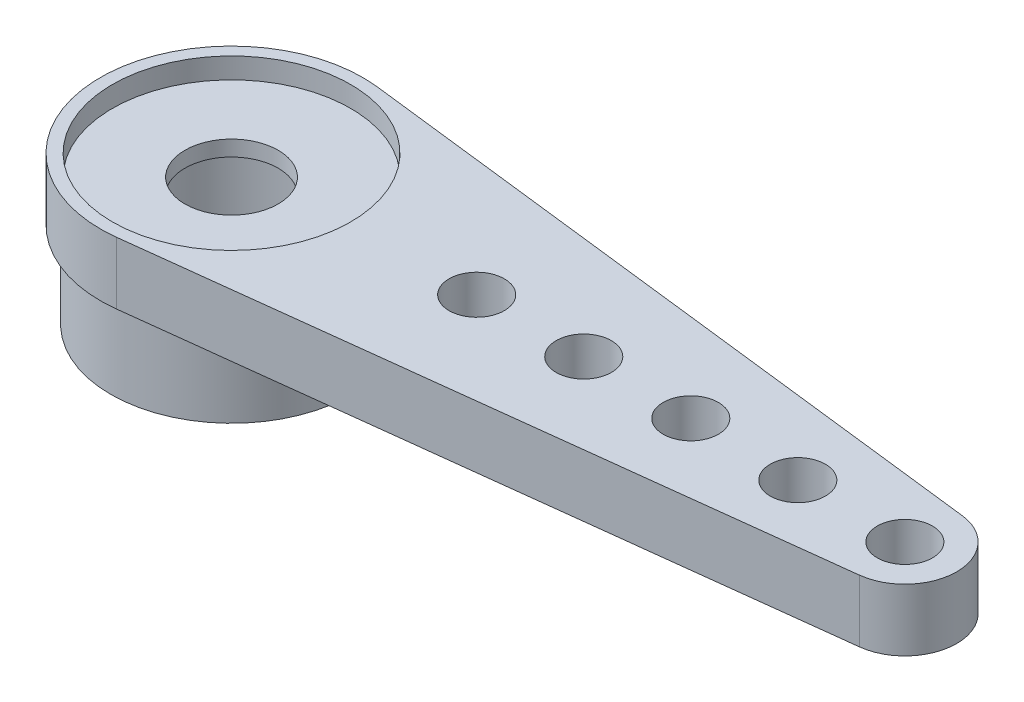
ISO-10303-21;
HEADER;
FILE_DESCRIPTION(('STEP AP214'),'2;1');
FILE_NAME('part.step','',(''),(''),'','','');
FILE_SCHEMA(('AUTOMOTIVE_DESIGN { 1 0 10303 214 1 1 1 1 }'));
ENDSEC;
DATA;
#1=APPLICATION_CONTEXT('core data for automotive mechanical design processes');
#2=APPLICATION_PROTOCOL_DEFINITION('international standard','automotive_design',2000,#1);
#3=PRODUCT_CONTEXT('',#1,'mechanical');
#4=PRODUCT('Part','Part','',(#3));
#5=PRODUCT_RELATED_PRODUCT_CATEGORY('part','',(#4));
#6=PRODUCT_DEFINITION_FORMATION('','',#4);
#7=PRODUCT_DEFINITION_CONTEXT('part definition',#1,'design');
#8=PRODUCT_DEFINITION('design','',#6,#7);
#9=PRODUCT_DEFINITION_SHAPE('','',#8);
#10=(LENGTH_UNIT() NAMED_UNIT(*) SI_UNIT(.MILLI.,.METRE.));
#11=(NAMED_UNIT(*) PLANE_ANGLE_UNIT() SI_UNIT($,.RADIAN.));
#12=(NAMED_UNIT(*) SI_UNIT($,.STERADIAN.) SOLID_ANGLE_UNIT());
#13=UNCERTAINTY_MEASURE_WITH_UNIT(LENGTH_MEASURE(1.E-05),#10,'distance_accuracy_value','');
#14=(GEOMETRIC_REPRESENTATION_CONTEXT(3) GLOBAL_UNCERTAINTY_ASSIGNED_CONTEXT((#13)) GLOBAL_UNIT_ASSIGNED_CONTEXT((#10,
#11,#12)) REPRESENTATION_CONTEXT('',''));
#15=CARTESIAN_POINT('',(0.,0.,0.));
#16=DIRECTION('',(0.,0.,1.));
#17=DIRECTION('',(1.,0.,0.));
#18=AXIS2_PLACEMENT_3D('',#15,#16,#17);
#19=CARTESIAN_POINT('',(0.,1.8,0.));
#20=DIRECTION('',(0.,-1.,0.));
#21=DIRECTION('',(0.,0.,-1.));
#22=AXIS2_PLACEMENT_3D('',#19,#20,#21);
#23=CYLINDRICAL_SURFACE('',#22,1.35);
#24=CARTESIAN_POINT('',(0.,0.75,0.));
#25=DIRECTION('',(0.,-1.,0.));
#26=DIRECTION('',(0.,0.,-1.));
#27=AXIS2_PLACEMENT_3D('',#24,#25,#26);
#28=CIRCLE('',#27,1.35);
#29=CARTESIAN_POINT('',(0.,0.75,-1.35));
#30=VERTEX_POINT('',#29);
#31=EDGE_CURVE('E113',#30,#30,#28,.T.);
#32=ORIENTED_EDGE('',*,*,#31,.T.);
#33=EDGE_LOOP('',(#32));
#34=FACE_BOUND('',#33,.T.);
#35=CARTESIAN_POINT('',(0.,1.2,0.));
#36=DIRECTION('',(0.,1.,0.));
#37=DIRECTION('',(0.,0.,1.));
#38=AXIS2_PLACEMENT_3D('',#35,#36,#37);
#39=CIRCLE('',#38,1.35);
#40=CARTESIAN_POINT('',(0.,1.2,1.35));
#41=VERTEX_POINT('',#40);
#42=EDGE_CURVE('E38',#41,#41,#39,.T.);
#43=ORIENTED_EDGE('',*,*,#42,.T.);
#44=EDGE_LOOP('',(#43));
#45=FACE_BOUND('',#44,.T.);
#46=ADVANCED_FACE('F34',(#34,#45),#23,.F.);
#47=CARTESIAN_POINT('',(0.,0.,0.));
#48=DIRECTION('',(0.,1.,0.));
#49=DIRECTION('',(0.,0.,1.));
#50=AXIS2_PLACEMENT_3D('',#47,#48,#49);
#51=PLANE('',#50);
#52=CARTESIAN_POINT('',(16.4,0.,0.));
#53=DIRECTION('',(0.,1.,0.));
#54=DIRECTION('',(0.,0.,1.));
#55=AXIS2_PLACEMENT_3D('',#52,#53,#54);
#56=CIRCLE('',#55,0.799999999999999);
#57=CARTESIAN_POINT('',(16.4,0.,0.799999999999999));
#58=VERTEX_POINT('',#57);
#59=EDGE_CURVE('E120',#58,#58,#56,.T.);
#60=ORIENTED_EDGE('',*,*,#59,.T.);
#61=EDGE_LOOP('',(#60));
#62=FACE_BOUND('',#61,.T.);
#63=CARTESIAN_POINT('',(10.2,0.,0.));
#64=DIRECTION('',(0.,1.,0.));
#65=DIRECTION('',(0.,0.,1.));
#66=AXIS2_PLACEMENT_3D('',#63,#64,#65);
#67=CIRCLE('',#66,0.800000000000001);
#68=CARTESIAN_POINT('',(10.2,0.,0.800000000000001));
#69=VERTEX_POINT('',#68);
#70=EDGE_CURVE('E142',#69,#69,#67,.T.);
#71=ORIENTED_EDGE('',*,*,#70,.T.);
#72=EDGE_LOOP('',(#71));
#73=FACE_BOUND('',#72,.T.);
#74=CARTESIAN_POINT('',(19.5,0.,0.));
#75=DIRECTION('',(0.,1.,0.));
#76=DIRECTION('',(0.,0.,1.));
#77=AXIS2_PLACEMENT_3D('',#74,#75,#76);
#78=CIRCLE('',#77,0.800000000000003);
#79=CARTESIAN_POINT('',(19.5,0.,0.800000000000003));
#80=VERTEX_POINT('',#79);
#81=EDGE_CURVE('E154',#80,#80,#78,.T.);
#82=ORIENTED_EDGE('',*,*,#81,.T.);
#83=EDGE_LOOP('',(#82));
#84=FACE_BOUND('',#83,.T.);
#85=CARTESIAN_POINT('',(0.,0.,0.));
#86=DIRECTION('',(0.,1.,0.));
#87=DIRECTION('',(0.,0.,1.));
#88=AXIS2_PLACEMENT_3D('',#85,#86,#87);
#89=CIRCLE('',#88,3.8);
#90=CARTESIAN_POINT('',(0.448205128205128,0.,-3.77347481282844));
#91=VERTEX_POINT('',#90);
#92=CARTESIAN_POINT('',(0.448205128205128,0.,3.77347481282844));
#93=VERTEX_POINT('',#92);
#94=EDGE_CURVE('E104',#91,#93,#89,.T.);
#95=ORIENTED_EDGE('',*,*,#94,.F.);
#96=DIRECTION('',(-0.993019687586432,0.,-0.117948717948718));
#97=VECTOR('',#96,1.);
#98=CARTESIAN_POINT('',(0.448205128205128,0.,-3.77347481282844));
#99=LINE('',#98,#97);
#100=CARTESIAN_POINT('',(19.6769230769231,0.,-1.48952953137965));
#101=VERTEX_POINT('',#100);
#102=EDGE_CURVE('E76',#101,#91,#99,.T.);
#103=ORIENTED_EDGE('',*,*,#102,.F.);
#104=CARTESIAN_POINT('',(19.5,0.,0.));
#105=DIRECTION('',(0.,1.,0.));
#106=DIRECTION('',(0.,0.,1.));
#107=AXIS2_PLACEMENT_3D('',#104,#105,#106);
#108=CIRCLE('',#107,1.5);
#109=CARTESIAN_POINT('',(19.6769230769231,0.,1.48952953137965));
#110=VERTEX_POINT('',#109);
#111=EDGE_CURVE('E70',#110,#101,#108,.T.);
#112=ORIENTED_EDGE('',*,*,#111,.F.);
#113=DIRECTION('',(0.993019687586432,0.,-0.117948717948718));
#114=VECTOR('',#113,1.);
#115=CARTESIAN_POINT('',(19.6769230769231,0.,1.48952953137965));
#116=LINE('',#115,#114);
#117=EDGE_CURVE('E95',#93,#110,#116,.T.);
#118=ORIENTED_EDGE('',*,*,#117,.F.);
#119=EDGE_LOOP('',(#95,#103,#112,#118));
#120=FACE_BOUND('',#119,.T.);
#121=CARTESIAN_POINT('',(7.1,0.,0.));
#122=DIRECTION('',(0.,1.,0.));
#123=DIRECTION('',(0.,0.,1.));
#124=AXIS2_PLACEMENT_3D('',#121,#122,#123);
#125=CIRCLE('',#124,0.800000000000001);
#126=CARTESIAN_POINT('',(7.1,0.,0.800000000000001));
#127=VERTEX_POINT('',#126);
#128=EDGE_CURVE('E148',#127,#127,#125,.T.);
#129=ORIENTED_EDGE('',*,*,#128,.T.);
#130=EDGE_LOOP('',(#129));
#131=FACE_BOUND('',#130,.T.);
#132=CARTESIAN_POINT('',(13.3,0.,0.));
#133=DIRECTION('',(0.,1.,0.));
#134=DIRECTION('',(0.,0.,1.));
#135=AXIS2_PLACEMENT_3D('',#132,#133,#134);
#136=CIRCLE('',#135,0.800000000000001);
#137=CARTESIAN_POINT('',(13.3,0.,0.800000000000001));
#138=VERTEX_POINT('',#137);
#139=EDGE_CURVE('E136',#138,#138,#136,.T.);
#140=ORIENTED_EDGE('',*,*,#139,.T.);
#141=EDGE_LOOP('',(#140));
#142=FACE_BOUND('',#141,.T.);
#143=CARTESIAN_POINT('',(0.,0.,0.));
#144=DIRECTION('',(0.,1.,0.));
#145=DIRECTION('',(0.,0.,1.));
#146=AXIS2_PLACEMENT_3D('',#143,#144,#145);
#147=CIRCLE('',#146,3.5);
#148=CARTESIAN_POINT('',(0.,0.,3.5));
#149=VERTEX_POINT('',#148);
#150=EDGE_CURVE('E11',#149,#149,#147,.F.);
#151=ORIENTED_EDGE('',*,*,#150,.F.);
#152=EDGE_LOOP('',(#151));
#153=FACE_BOUND('',#152,.T.);
#154=ADVANCED_FACE('F162',(#62,#73,#84,#120,#131,#142,#153),#51,.F.);
#155=CARTESIAN_POINT('',(0.,1.8,0.));
#156=DIRECTION('',(0.,1.,0.));
#157=DIRECTION('',(0.,0.,1.));
#158=AXIS2_PLACEMENT_3D('',#155,#156,#157);
#159=PLANE('',#158);
#160=CARTESIAN_POINT('',(0.,1.8,0.));
#161=DIRECTION('',(0.,1.,0.));
#162=DIRECTION('',(0.,0.,1.));
#163=AXIS2_PLACEMENT_3D('',#160,#161,#162);
#164=CIRCLE('',#163,3.45);
#165=CARTESIAN_POINT('',(0.,1.8,3.45));
#166=VERTEX_POINT('',#165);
#167=EDGE_CURVE('E130',#166,#166,#164,.T.);
#168=ORIENTED_EDGE('',*,*,#167,.F.);
#169=EDGE_LOOP('',(#168));
#170=FACE_BOUND('',#169,.T.);
#171=CARTESIAN_POINT('',(13.3,1.8,0.));
#172=DIRECTION('',(0.,1.,0.));
#173=DIRECTION('',(0.,0.,1.));
#174=AXIS2_PLACEMENT_3D('',#171,#172,#173);
#175=CIRCLE('',#174,0.800000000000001);
#176=CARTESIAN_POINT('',(13.3,1.8,0.800000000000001));
#177=VERTEX_POINT('',#176);
#178=EDGE_CURVE('E139',#177,#177,#175,.T.);
#179=ORIENTED_EDGE('',*,*,#178,.F.);
#180=EDGE_LOOP('',(#179));
#181=FACE_BOUND('',#180,.T.);
#182=CARTESIAN_POINT('',(7.1,1.8,0.));
#183=DIRECTION('',(0.,1.,0.));
#184=DIRECTION('',(0.,0.,1.));
#185=AXIS2_PLACEMENT_3D('',#182,#183,#184);
#186=CIRCLE('',#185,0.800000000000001);
#187=CARTESIAN_POINT('',(7.1,1.8,0.800000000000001));
#188=VERTEX_POINT('',#187);
#189=EDGE_CURVE('E151',#188,#188,#186,.T.);
#190=ORIENTED_EDGE('',*,*,#189,.F.);
#191=EDGE_LOOP('',(#190));
#192=FACE_BOUND('',#191,.T.);
#193=CARTESIAN_POINT('',(0.,1.8,0.));
#194=DIRECTION('',(0.,1.,0.));
#195=DIRECTION('',(0.,0.,1.));
#196=AXIS2_PLACEMENT_3D('',#193,#194,#195);
#197=CIRCLE('',#196,3.8);
#198=CARTESIAN_POINT('',(0.448205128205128,1.8,-3.77347481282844));
#199=VERTEX_POINT('',#198);
#200=CARTESIAN_POINT('',(0.448205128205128,1.8,3.77347481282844));
#201=VERTEX_POINT('',#200);
#202=EDGE_CURVE('E90',#199,#201,#197,.T.);
#203=ORIENTED_EDGE('',*,*,#202,.T.);
#204=DIRECTION('',(0.993019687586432,0.,-0.117948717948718));
#205=VECTOR('',#204,1.);
#206=CARTESIAN_POINT('',(19.6769230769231,1.8,1.48952953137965));
#207=LINE('',#206,#205);
#208=CARTESIAN_POINT('',(19.6769230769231,1.8,1.48952953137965));
#209=VERTEX_POINT('',#208);
#210=EDGE_CURVE('E84',#201,#209,#207,.T.);
#211=ORIENTED_EDGE('',*,*,#210,.T.);
#212=CARTESIAN_POINT('',(19.5,1.8,0.));
#213=DIRECTION('',(0.,1.,0.));
#214=DIRECTION('',(0.,0.,1.));
#215=AXIS2_PLACEMENT_3D('',#212,#213,#214);
#216=CIRCLE('',#215,1.5);
#217=CARTESIAN_POINT('',(19.6769230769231,1.8,-1.48952953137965));
#218=VERTEX_POINT('',#217);
#219=EDGE_CURVE('E88',#209,#218,#216,.T.);
#220=ORIENTED_EDGE('',*,*,#219,.T.);
#221=DIRECTION('',(-0.993019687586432,0.,-0.117948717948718));
#222=VECTOR('',#221,1.);
#223=CARTESIAN_POINT('',(0.448205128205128,1.8,-3.77347481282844));
#224=LINE('',#223,#222);
#225=EDGE_CURVE('E53',#218,#199,#224,.T.);
#226=ORIENTED_EDGE('',*,*,#225,.T.);
#227=EDGE_LOOP('',(#203,#211,#220,#226));
#228=FACE_BOUND('',#227,.T.);
#229=CARTESIAN_POINT('',(19.5,1.8,0.));
#230=DIRECTION('',(0.,1.,0.));
#231=DIRECTION('',(0.,0.,1.));
#232=AXIS2_PLACEMENT_3D('',#229,#230,#231);
#233=CIRCLE('',#232,0.800000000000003);
#234=CARTESIAN_POINT('',(19.5,1.8,0.800000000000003));
#235=VERTEX_POINT('',#234);
#236=EDGE_CURVE('E107',#235,#235,#233,.T.);
#237=ORIENTED_EDGE('',*,*,#236,.F.);
#238=EDGE_LOOP('',(#237));
#239=FACE_BOUND('',#238,.T.);
#240=CARTESIAN_POINT('',(10.2,1.8,0.));
#241=DIRECTION('',(0.,1.,0.));
#242=DIRECTION('',(0.,0.,1.));
#243=AXIS2_PLACEMENT_3D('',#240,#241,#242);
#244=CIRCLE('',#243,0.800000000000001);
#245=CARTESIAN_POINT('',(10.2,1.8,0.800000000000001));
#246=VERTEX_POINT('',#245);
#247=EDGE_CURVE('E145',#246,#246,#244,.T.);
#248=ORIENTED_EDGE('',*,*,#247,.F.);
#249=EDGE_LOOP('',(#248));
#250=FACE_BOUND('',#249,.T.);
#251=CARTESIAN_POINT('',(16.4,1.8,0.));
#252=DIRECTION('',(0.,1.,0.));
#253=DIRECTION('',(0.,0.,1.));
#254=AXIS2_PLACEMENT_3D('',#251,#252,#253);
#255=CIRCLE('',#254,0.799999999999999);
#256=CARTESIAN_POINT('',(16.4,1.8,0.799999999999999));
#257=VERTEX_POINT('',#256);
#258=EDGE_CURVE('E133',#257,#257,#255,.T.);
#259=ORIENTED_EDGE('',*,*,#258,.F.);
#260=EDGE_LOOP('',(#259));
#261=FACE_BOUND('',#260,.T.);
#262=ADVANCED_FACE('F85',(#170,#181,#192,#228,#239,#250,#261),#159,.T.);
#263=CARTESIAN_POINT('',(0.,1.8,0.));
#264=DIRECTION('',(0.,-1.,0.));
#265=DIRECTION('',(0.,0.,-1.));
#266=AXIS2_PLACEMENT_3D('',#263,#264,#265);
#267=CYLINDRICAL_SURFACE('',#266,3.8);
#268=ORIENTED_EDGE('',*,*,#94,.T.);
#269=DIRECTION('',(0.,-1.,0.));
#270=VECTOR('',#269,1.);
#271=CARTESIAN_POINT('',(0.448205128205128,1.8,3.77347481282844));
#272=LINE('',#271,#270);
#273=EDGE_CURVE('E44',#201,#93,#272,.T.);
#274=ORIENTED_EDGE('',*,*,#273,.F.);
#275=ORIENTED_EDGE('',*,*,#202,.F.);
#276=DIRECTION('',(0.,-1.,0.));
#277=VECTOR('',#276,1.);
#278=CARTESIAN_POINT('',(0.448205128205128,1.8,-3.77347481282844));
#279=LINE('',#278,#277);
#280=EDGE_CURVE('E100',#199,#91,#279,.T.);
#281=ORIENTED_EDGE('',*,*,#280,.T.);
#282=EDGE_LOOP('',(#268,#274,#275,#281));
#283=FACE_BOUND('',#282,.T.);
#284=ADVANCED_FACE('F36',(#283),#267,.T.);
#285=CARTESIAN_POINT('',(19.6769230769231,1.8,1.48952953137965));
#286=DIRECTION('',(-0.117948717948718,0.,-0.993019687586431));
#287=DIRECTION('',(-0.993019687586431,0.,0.117948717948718));
#288=AXIS2_PLACEMENT_3D('',#285,#286,#287);
#289=PLANE('',#288);
#290=ORIENTED_EDGE('',*,*,#117,.T.);
#291=DIRECTION('',(0.,-1.,0.));
#292=VECTOR('',#291,1.);
#293=CARTESIAN_POINT('',(19.6769230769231,1.8,1.48952953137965));
#294=LINE('',#293,#292);
#295=EDGE_CURVE('E93',#209,#110,#294,.T.);
#296=ORIENTED_EDGE('',*,*,#295,.F.);
#297=ORIENTED_EDGE('',*,*,#210,.F.);
#298=ORIENTED_EDGE('',*,*,#273,.T.);
#299=EDGE_LOOP('',(#290,#296,#297,#298));
#300=FACE_BOUND('',#299,.T.);
#301=ADVANCED_FACE('F94',(#300),#289,.F.);
#302=CARTESIAN_POINT('',(19.5,1.8,0.));
#303=DIRECTION('',(0.,-1.,0.));
#304=DIRECTION('',(0.,0.,-1.));
#305=AXIS2_PLACEMENT_3D('',#302,#303,#304);
#306=CYLINDRICAL_SURFACE('',#305,1.5);
#307=ORIENTED_EDGE('',*,*,#111,.T.);
#308=DIRECTION('',(0.,-1.,0.));
#309=VECTOR('',#308,1.);
#310=CARTESIAN_POINT('',(19.6769230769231,1.8,-1.48952953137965));
#311=LINE('',#310,#309);
#312=EDGE_CURVE('E96',#218,#101,#311,.T.);
#313=ORIENTED_EDGE('',*,*,#312,.F.);
#314=ORIENTED_EDGE('',*,*,#219,.F.);
#315=ORIENTED_EDGE('',*,*,#295,.T.);
#316=EDGE_LOOP('',(#307,#313,#314,#315));
#317=FACE_BOUND('',#316,.T.);
#318=ADVANCED_FACE('F98',(#317),#306,.T.);
#319=CARTESIAN_POINT('',(0.448205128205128,1.8,-3.77347481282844));
#320=DIRECTION('',(-0.117948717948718,0.,0.993019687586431));
#321=DIRECTION('',(0.993019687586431,0.,0.117948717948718));
#322=AXIS2_PLACEMENT_3D('',#319,#320,#321);
#323=PLANE('',#322);
#324=ORIENTED_EDGE('',*,*,#102,.T.);
#325=ORIENTED_EDGE('',*,*,#280,.F.);
#326=ORIENTED_EDGE('',*,*,#225,.F.);
#327=ORIENTED_EDGE('',*,*,#312,.T.);
#328=EDGE_LOOP('',(#324,#325,#326,#327));
#329=FACE_BOUND('',#328,.T.);
#330=ADVANCED_FACE('F168',(#329),#323,.F.);
#331=CARTESIAN_POINT('',(19.5,1.8,0.));
#332=DIRECTION('',(0.,-1.,0.));
#333=DIRECTION('',(0.,0.,-1.));
#334=AXIS2_PLACEMENT_3D('',#331,#332,#333);
#335=CYLINDRICAL_SURFACE('',#334,0.800000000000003);
#336=ORIENTED_EDGE('',*,*,#236,.T.);
#337=EDGE_LOOP('',(#336));
#338=FACE_BOUND('',#337,.T.);
#339=ORIENTED_EDGE('',*,*,#81,.F.);
#340=EDGE_LOOP('',(#339));
#341=FACE_BOUND('',#340,.T.);
#342=ADVANCED_FACE('F165',(#338,#341),#335,.F.);
#343=CARTESIAN_POINT('',(7.1,1.8,0.));
#344=DIRECTION('',(0.,-1.,0.));
#345=DIRECTION('',(0.,0.,-1.));
#346=AXIS2_PLACEMENT_3D('',#343,#344,#345);
#347=CYLINDRICAL_SURFACE('',#346,0.800000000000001);
#348=ORIENTED_EDGE('',*,*,#189,.T.);
#349=EDGE_LOOP('',(#348));
#350=FACE_BOUND('',#349,.T.);
#351=ORIENTED_EDGE('',*,*,#128,.F.);
#352=EDGE_LOOP('',(#351));
#353=FACE_BOUND('',#352,.T.);
#354=ADVANCED_FACE('F167',(#350,#353),#347,.F.);
#355=CARTESIAN_POINT('',(10.2,1.8,0.));
#356=DIRECTION('',(0.,-1.,0.));
#357=DIRECTION('',(0.,0.,-1.));
#358=AXIS2_PLACEMENT_3D('',#355,#356,#357);
#359=CYLINDRICAL_SURFACE('',#358,0.800000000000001);
#360=ORIENTED_EDGE('',*,*,#247,.T.);
#361=EDGE_LOOP('',(#360));
#362=FACE_BOUND('',#361,.T.);
#363=ORIENTED_EDGE('',*,*,#70,.F.);
#364=EDGE_LOOP('',(#363));
#365=FACE_BOUND('',#364,.T.);
#366=ADVANCED_FACE('F175',(#362,#365),#359,.F.);
#367=CARTESIAN_POINT('',(13.3,1.8,0.));
#368=DIRECTION('',(0.,-1.,0.));
#369=DIRECTION('',(0.,0.,-1.));
#370=AXIS2_PLACEMENT_3D('',#367,#368,#369);
#371=CYLINDRICAL_SURFACE('',#370,0.800000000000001);
#372=ORIENTED_EDGE('',*,*,#178,.T.);
#373=EDGE_LOOP('',(#372));
#374=FACE_BOUND('',#373,.T.);
#375=ORIENTED_EDGE('',*,*,#139,.F.);
#376=EDGE_LOOP('',(#375));
#377=FACE_BOUND('',#376,.T.);
#378=ADVANCED_FACE('F220',(#374,#377),#371,.F.);
#379=CARTESIAN_POINT('',(16.4,1.8,0.));
#380=DIRECTION('',(0.,-1.,0.));
#381=DIRECTION('',(0.,0.,-1.));
#382=AXIS2_PLACEMENT_3D('',#379,#380,#381);
#383=CYLINDRICAL_SURFACE('',#382,0.799999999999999);
#384=ORIENTED_EDGE('',*,*,#258,.T.);
#385=EDGE_LOOP('',(#384));
#386=FACE_BOUND('',#385,.T.);
#387=ORIENTED_EDGE('',*,*,#59,.F.);
#388=EDGE_LOOP('',(#387));
#389=FACE_BOUND('',#388,.T.);
#390=ADVANCED_FACE('F210',(#386,#389),#383,.F.);
#391=CARTESIAN_POINT('',(0.,-2.5,0.));
#392=DIRECTION('',(0.,1.,0.));
#393=DIRECTION('',(0.,0.,1.));
#394=AXIS2_PLACEMENT_3D('',#391,#392,#393);
#395=CYLINDRICAL_SURFACE('',#394,3.5);
#396=CARTESIAN_POINT('',(0.,-2.5,0.));
#397=DIRECTION('',(0.,-1.,0.));
#398=DIRECTION('',(0.,0.,-1.));
#399=AXIS2_PLACEMENT_3D('',#396,#397,#398);
#400=CIRCLE('',#399,3.5);
#401=CARTESIAN_POINT('',(0.,-2.5,-3.5));
#402=VERTEX_POINT('',#401);
#403=EDGE_CURVE('E115',#402,#402,#400,.T.);
#404=ORIENTED_EDGE('',*,*,#403,.F.);
#405=EDGE_LOOP('',(#404));
#406=FACE_BOUND('',#405,.T.);
#407=ORIENTED_EDGE('',*,*,#150,.T.);
#408=EDGE_LOOP('',(#407));
#409=FACE_BOUND('',#408,.T.);
#410=ADVANCED_FACE('F207',(#406,#409),#395,.T.);
#411=CARTESIAN_POINT('',(0.,-2.5,0.));
#412=DIRECTION('',(0.,-1.,0.));
#413=DIRECTION('',(0.,0.,-1.));
#414=AXIS2_PLACEMENT_3D('',#411,#412,#413);
#415=PLANE('',#414);
#416=CARTESIAN_POINT('',(0.,-2.5,0.));
#417=DIRECTION('',(0.,-1.,0.));
#418=DIRECTION('',(0.,0.,-1.));
#419=AXIS2_PLACEMENT_3D('',#416,#417,#418);
#420=CIRCLE('',#419,2.5);
#421=CARTESIAN_POINT('',(0.,-2.5,-2.5));
#422=VERTEX_POINT('',#421);
#423=EDGE_CURVE('E123',#422,#422,#420,.T.);
#424=ORIENTED_EDGE('',*,*,#423,.F.);
#425=EDGE_LOOP('',(#424));
#426=FACE_BOUND('',#425,.T.);
#427=ORIENTED_EDGE('',*,*,#403,.T.);
#428=EDGE_LOOP('',(#427));
#429=FACE_BOUND('',#428,.T.);
#430=ADVANCED_FACE('F209',(#426,#429),#415,.T.);
#431=CARTESIAN_POINT('',(0.,0.75,0.));
#432=DIRECTION('',(0.,-1.,0.));
#433=DIRECTION('',(0.,0.,-1.));
#434=AXIS2_PLACEMENT_3D('',#431,#432,#433);
#435=CYLINDRICAL_SURFACE('',#434,2.5);
#436=CARTESIAN_POINT('',(0.,0.75,0.));
#437=DIRECTION('',(0.,-1.,0.));
#438=DIRECTION('',(0.,0.,-1.));
#439=AXIS2_PLACEMENT_3D('',#436,#437,#438);
#440=CIRCLE('',#439,2.5);
#441=CARTESIAN_POINT('',(0.,0.75,-2.5));
#442=VERTEX_POINT('',#441);
#443=EDGE_CURVE('E116',#442,#442,#440,.T.);
#444=CARTESIAN_POINT('',(0.,0.75,-2.5));
#445=CARTESIAN_POINT('',(0.,0.716145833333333,-2.5));
#446=CARTESIAN_POINT('',(0.,0.682291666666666,-2.5));
#447=CARTESIAN_POINT('',(0.,0.614583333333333,-2.5));
#448=CARTESIAN_POINT('',(0.,0.580729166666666,-2.5));
#449=CARTESIAN_POINT('',(0.,0.513020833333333,-2.5));
#450=CARTESIAN_POINT('',(0.,0.479166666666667,-2.5));
#451=CARTESIAN_POINT('',(0.,0.411458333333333,-2.5));
#452=CARTESIAN_POINT('',(0.,0.377604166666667,-2.5));
#453=CARTESIAN_POINT('',(0.,0.309895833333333,-2.5));
#454=CARTESIAN_POINT('',(0.,0.276041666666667,-2.5));
#455=CARTESIAN_POINT('',(0.,0.208333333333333,-2.5));
#456=CARTESIAN_POINT('',(0.,0.174479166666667,-2.5));
#457=CARTESIAN_POINT('',(0.,0.106770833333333,-2.5));
#458=CARTESIAN_POINT('',(0.,0.0729166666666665,-2.5));
#459=CARTESIAN_POINT('',(0.,0.00520833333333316,-2.5));
#460=CARTESIAN_POINT('',(0.,-0.0286458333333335,-2.5));
#461=CARTESIAN_POINT('',(0.,-0.0963541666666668,-2.5));
#462=CARTESIAN_POINT('',(0.,-0.130208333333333,-2.5));
#463=CARTESIAN_POINT('',(0.,-0.197916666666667,-2.5));
#464=CARTESIAN_POINT('',(0.,-0.231770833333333,-2.5));
#465=CARTESIAN_POINT('',(0.,-0.299479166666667,-2.5));
#466=CARTESIAN_POINT('',(0.,-0.333333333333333,-2.5));
#467=CARTESIAN_POINT('',(0.,-0.401041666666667,-2.5));
#468=CARTESIAN_POINT('',(0.,-0.434895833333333,-2.5));
#469=CARTESIAN_POINT('',(0.,-0.502604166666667,-2.5));
#470=CARTESIAN_POINT('',(0.,-0.536458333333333,-2.5));
#471=CARTESIAN_POINT('',(0.,-0.604166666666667,-2.5));
#472=CARTESIAN_POINT('',(0.,-0.638020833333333,-2.5));
#473=CARTESIAN_POINT('',(0.,-0.705729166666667,-2.5));
#474=CARTESIAN_POINT('',(0.,-0.739583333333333,-2.5));
#475=CARTESIAN_POINT('',(0.,-0.807291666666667,-2.5));
#476=CARTESIAN_POINT('',(0.,-0.841145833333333,-2.5));
#477=CARTESIAN_POINT('',(0.,-0.908854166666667,-2.5));
#478=CARTESIAN_POINT('',(0.,-0.942708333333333,-2.5));
#479=CARTESIAN_POINT('',(0.,-1.01041666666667,-2.5));
#480=CARTESIAN_POINT('',(0.,-1.04427083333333,-2.5));
#481=CARTESIAN_POINT('',(0.,-1.11197916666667,-2.5));
#482=CARTESIAN_POINT('',(0.,-1.14583333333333,-2.5));
#483=CARTESIAN_POINT('',(0.,-1.21354166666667,-2.5));
#484=CARTESIAN_POINT('',(0.,-1.24739583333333,-2.5));
#485=CARTESIAN_POINT('',(0.,-1.31510416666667,-2.5));
#486=CARTESIAN_POINT('',(0.,-1.34895833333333,-2.5));
#487=CARTESIAN_POINT('',(0.,-1.41666666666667,-2.5));
#488=CARTESIAN_POINT('',(0.,-1.45052083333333,-2.5));
#489=CARTESIAN_POINT('',(0.,-1.51822916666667,-2.5));
#490=CARTESIAN_POINT('',(0.,-1.55208333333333,-2.5));
#491=CARTESIAN_POINT('',(0.,-1.61979166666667,-2.5));
#492=CARTESIAN_POINT('',(0.,-1.65364583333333,-2.5));
#493=CARTESIAN_POINT('',(0.,-1.72135416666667,-2.5));
#494=CARTESIAN_POINT('',(0.,-1.75520833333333,-2.5));
#495=CARTESIAN_POINT('',(0.,-1.82291666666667,-2.5));
#496=CARTESIAN_POINT('',(0.,-1.85677083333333,-2.5));
#497=CARTESIAN_POINT('',(0.,-1.92447916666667,-2.5));
#498=CARTESIAN_POINT('',(0.,-1.95833333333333,-2.5));
#499=CARTESIAN_POINT('',(0.,-2.02604166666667,-2.5));
#500=CARTESIAN_POINT('',(0.,-2.05989583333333,-2.5));
#501=CARTESIAN_POINT('',(0.,-2.12760416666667,-2.5));
#502=CARTESIAN_POINT('',(0.,-2.16145833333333,-2.5));
#503=CARTESIAN_POINT('',(0.,-2.22916666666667,-2.5));
#504=CARTESIAN_POINT('',(0.,-2.26302083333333,-2.5));
#505=CARTESIAN_POINT('',(0.,-2.33072916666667,-2.5));
#506=CARTESIAN_POINT('',(0.,-2.36458333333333,-2.5));
#507=CARTESIAN_POINT('',(0.,-2.43229166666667,-2.5));
#508=CARTESIAN_POINT('',(0.,-2.46614583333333,-2.5));
#509=CARTESIAN_POINT('',(0.,-2.5,-2.5));
#510=B_SPLINE_CURVE_WITH_KNOTS('',3,(#444,#445,#446,#447,#448,#449,#450,#451,#452,#453,#454,
#455,#456,#457,#458,#459,#460,#461,#462,#463,#464,#465,#466,#467,#468,#469,#470,#471,#472,#473,
#474,#475,#476,#477,#478,#479,#480,#481,#482,#483,#484,#485,#486,#487,#488,#489,#490,#491,#492,
#493,#494,#495,#496,#497,#498,#499,#500,#501,#502,#503,#504,#505,#506,#507,#508,#509),
.UNSPECIFIED.,.F.,.F.,(4,2,2,2,2,2,2,2,2,2,2,2,2,2,2,2,2,2,2,2,2,2,2,2,2,2,2,2,2,2,2,2,4),(0.,
0.1015625,0.203125,0.3046875,0.40625,0.5078125,0.609375,0.7109375,0.8125,0.9140625,1.015625,
1.1171875,1.21875,1.3203125,1.421875,1.5234375,1.625,1.7265625,1.828125,1.9296875,2.03125,
2.1328125,2.234375,2.3359375,2.4375,2.5390625,2.640625,2.7421875,2.84375,2.9453125,3.046875,
3.1484375,3.25),.UNSPECIFIED.);
#511=EDGE_CURVE('BSEAM217',#442,#422,#510,.T.);
#512=ORIENTED_EDGE('',*,*,#443,.F.);
#513=ORIENTED_EDGE('',*,*,#423,.T.);
#514=ORIENTED_EDGE('',*,*,#511,.T.);
#515=ORIENTED_EDGE('',*,*,#511,.F.);
#516=EDGE_LOOP('',(#512,#514,#513,#515));
#517=FACE_BOUND('',#516,.T.);
#518=ADVANCED_FACE('F217',(#517),#435,.F.);
#519=CARTESIAN_POINT('',(0.,0.75,0.));
#520=DIRECTION('',(0.,-1.,0.));
#521=DIRECTION('',(0.,0.,-1.));
#522=AXIS2_PLACEMENT_3D('',#519,#520,#521);
#523=PLANE('',#522);
#524=ORIENTED_EDGE('',*,*,#31,.F.);
#525=EDGE_LOOP('',(#524));
#526=FACE_BOUND('',#525,.T.);
#527=ORIENTED_EDGE('',*,*,#443,.T.);
#528=EDGE_LOOP('',(#527));
#529=FACE_BOUND('',#528,.T.);
#530=ADVANCED_FACE('F277',(#526,#529),#523,.T.);
#531=CARTESIAN_POINT('',(0.,1.2,0.));
#532=DIRECTION('',(0.,1.,0.));
#533=DIRECTION('',(0.,0.,1.));
#534=AXIS2_PLACEMENT_3D('',#531,#532,#533);
#535=CYLINDRICAL_SURFACE('',#534,3.45);
#536=CARTESIAN_POINT('',(0.,1.2,0.));
#537=DIRECTION('',(0.,1.,0.));
#538=DIRECTION('',(0.,0.,1.));
#539=AXIS2_PLACEMENT_3D('',#536,#537,#538);
#540=CIRCLE('',#539,3.45);
#541=CARTESIAN_POINT('',(0.,1.2,3.45));
#542=VERTEX_POINT('',#541);
#543=EDGE_CURVE('E326',#542,#542,#540,.T.);
#544=ORIENTED_EDGE('',*,*,#543,.F.);
#545=EDGE_LOOP('',(#544));
#546=FACE_BOUND('',#545,.T.);
#547=ORIENTED_EDGE('',*,*,#167,.T.);
#548=EDGE_LOOP('',(#547));
#549=FACE_BOUND('',#548,.T.);
#550=ADVANCED_FACE('F285',(#546,#549),#535,.F.);
#551=CARTESIAN_POINT('',(0.,1.2,0.));
#552=DIRECTION('',(0.,1.,0.));
#553=DIRECTION('',(0.,0.,1.));
#554=AXIS2_PLACEMENT_3D('',#551,#552,#553);
#555=PLANE('',#554);
#556=ORIENTED_EDGE('',*,*,#42,.F.);
#557=EDGE_LOOP('',(#556));
#558=FACE_BOUND('',#557,.T.);
#559=ORIENTED_EDGE('',*,*,#543,.T.);
#560=EDGE_LOOP('',(#559));
#561=FACE_BOUND('',#560,.T.);
#562=ADVANCED_FACE('F307',(#558,#561),#555,.T.);
#563=CLOSED_SHELL('',(#46,#154,#262,#284,#301,#318,#330,#342,#354,#366,#378,#390,#410,#430,#518,
#530,#550,#562));
#564=MANIFOLD_SOLID_BREP('B2',#563);
#565=ADVANCED_BREP_SHAPE_REPRESENTATION('',(#18,#564),#14);
#566=SHAPE_DEFINITION_REPRESENTATION(#9,#565);
ENDSEC;
END-ISO-10303-21;
